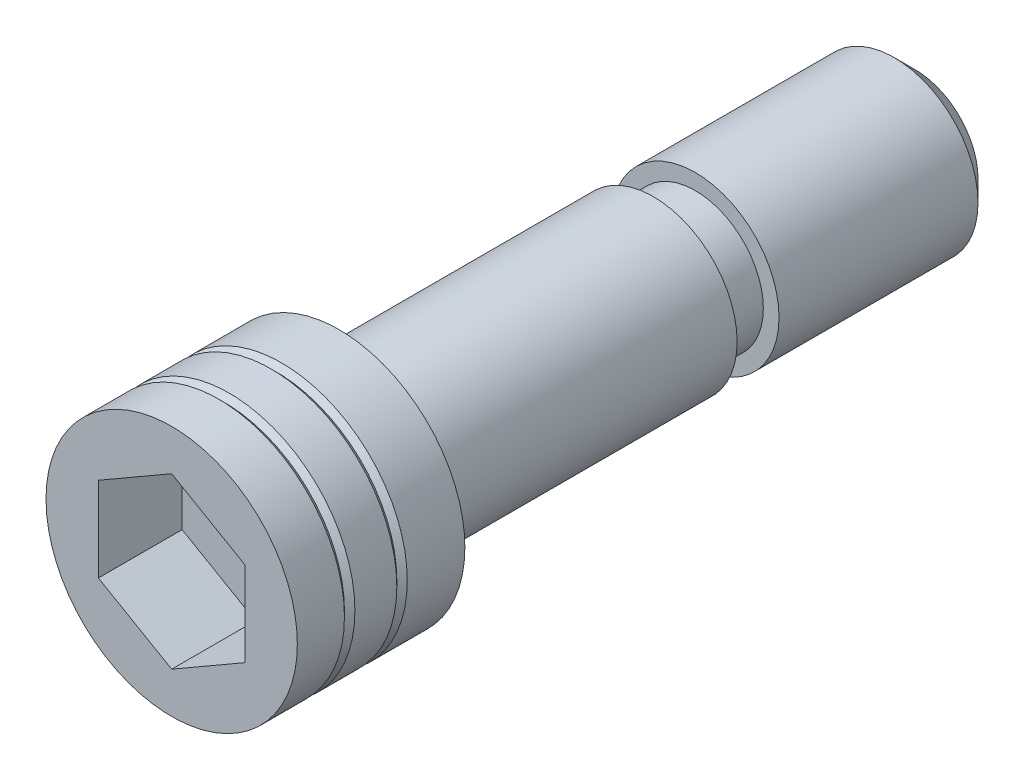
ISO-10303-21;
HEADER;
FILE_DESCRIPTION(('STEP AP214'),'2;1');
FILE_NAME('part.step','',(''),(''),'','','');
FILE_SCHEMA(('AUTOMOTIVE_DESIGN { 1 0 10303 214 1 1 1 1 }'));
ENDSEC;
DATA;
#1=APPLICATION_CONTEXT('core data for automotive mechanical design processes');
#2=APPLICATION_PROTOCOL_DEFINITION('international standard','automotive_design',2000,#1);
#3=PRODUCT_CONTEXT('',#1,'mechanical');
#4=PRODUCT('Part','Part','',(#3));
#5=PRODUCT_RELATED_PRODUCT_CATEGORY('part','',(#4));
#6=PRODUCT_DEFINITION_FORMATION('','',#4);
#7=PRODUCT_DEFINITION_CONTEXT('part definition',#1,'design');
#8=PRODUCT_DEFINITION('design','',#6,#7);
#9=PRODUCT_DEFINITION_SHAPE('','',#8);
#10=(LENGTH_UNIT() NAMED_UNIT(*) SI_UNIT(.MILLI.,.METRE.));
#11=(NAMED_UNIT(*) PLANE_ANGLE_UNIT() SI_UNIT($,.RADIAN.));
#12=(NAMED_UNIT(*) SI_UNIT($,.STERADIAN.) SOLID_ANGLE_UNIT());
#13=UNCERTAINTY_MEASURE_WITH_UNIT(LENGTH_MEASURE(1.E-05),#10,'distance_accuracy_value','');
#14=(GEOMETRIC_REPRESENTATION_CONTEXT(3) GLOBAL_UNCERTAINTY_ASSIGNED_CONTEXT((#13)) GLOBAL_UNIT_ASSIGNED_CONTEXT((#10,
#11,#12)) REPRESENTATION_CONTEXT('',''));
#15=CARTESIAN_POINT('',(0.,0.,0.));
#16=DIRECTION('',(0.,0.,1.));
#17=DIRECTION('',(1.,0.,0.));
#18=AXIS2_PLACEMENT_3D('',#15,#16,#17);
#19=CARTESIAN_POINT('',(0.,0.,25.));
#20=DIRECTION('',(0.,0.,1.));
#21=DIRECTION('',(1.,0.,0.));
#22=AXIS2_PLACEMENT_3D('',#19,#20,#21);
#23=CYLINDRICAL_SURFACE('',#22,12.);
#24=CARTESIAN_POINT('',(0.,0.,0.));
#25=DIRECTION('',(0.,0.,1.));
#26=DIRECTION('',(1.,0.,0.));
#27=AXIS2_PLACEMENT_3D('',#24,#25,#26);
#28=CIRCLE('',#27,12.);
#29=CARTESIAN_POINT('',(12.,0.,0.));
#30=VERTEX_POINT('',#29);
#31=EDGE_CURVE('E23',#30,#30,#28,.T.);
#32=ORIENTED_EDGE('',*,*,#31,.T.);
#33=EDGE_LOOP('',(#32));
#34=FACE_BOUND('',#33,.T.);
#35=CARTESIAN_POINT('',(0.,0.,5.5));
#36=DIRECTION('',(0.,0.,-1.));
#37=DIRECTION('',(-1.,0.,0.));
#38=AXIS2_PLACEMENT_3D('',#35,#36,#37);
#39=CIRCLE('',#38,12.);
#40=CARTESIAN_POINT('',(-12.,0.,5.5));
#41=VERTEX_POINT('',#40);
#42=EDGE_CURVE('E18',#41,#41,#39,.F.);
#43=ORIENTED_EDGE('',*,*,#42,.F.);
#44=EDGE_LOOP('',(#43));
#45=FACE_BOUND('',#44,.T.);
#46=ADVANCED_FACE('F14',(#34,#45),#23,.T.);
#47=CARTESIAN_POINT('',(-8.,0.,0.));
#48=DIRECTION('',(0.,0.,1.));
#49=DIRECTION('',(1.,0.,0.));
#50=AXIS2_PLACEMENT_3D('',#47,#48,#49);
#51=PLANE('',#50);
#52=ORIENTED_EDGE('',*,*,#31,.F.);
#53=EDGE_LOOP('',(#52));
#54=FACE_BOUND('',#53,.T.);
#55=CARTESIAN_POINT('',(0.,0.,0.));
#56=DIRECTION('',(0.,0.,1.));
#57=DIRECTION('',(1.,0.,0.));
#58=AXIS2_PLACEMENT_3D('',#55,#56,#57);
#59=CIRCLE('',#58,8.);
#60=CARTESIAN_POINT('',(8.,0.,0.));
#61=VERTEX_POINT('',#60);
#62=EDGE_CURVE('E142',#61,#61,#59,.T.);
#63=ORIENTED_EDGE('',*,*,#62,.T.);
#64=EDGE_LOOP('',(#63));
#65=FACE_BOUND('',#64,.T.);
#66=ADVANCED_FACE('F187',(#54,#65),#51,.F.);
#67=CARTESIAN_POINT('',(0.,0.,25.));
#68=DIRECTION('',(0.,0.,1.));
#69=DIRECTION('',(1.,0.,0.));
#70=AXIS2_PLACEMENT_3D('',#67,#68,#69);
#71=CYLINDRICAL_SURFACE('',#70,8.);
#72=ORIENTED_EDGE('',*,*,#62,.F.);
#73=EDGE_LOOP('',(#72));
#74=FACE_BOUND('',#73,.T.);
#75=CARTESIAN_POINT('',(0.,0.,-30.));
#76=DIRECTION('',(0.,0.,1.));
#77=DIRECTION('',(1.,0.,0.));
#78=AXIS2_PLACEMENT_3D('',#75,#76,#77);
#79=CIRCLE('',#78,8.);
#80=CARTESIAN_POINT('',(8.,0.,-30.));
#81=VERTEX_POINT('',#80);
#82=EDGE_CURVE('E139',#81,#81,#79,.T.);
#83=ORIENTED_EDGE('',*,*,#82,.T.);
#84=EDGE_LOOP('',(#83));
#85=FACE_BOUND('',#84,.T.);
#86=ADVANCED_FACE('F248',(#74,#85),#71,.T.);
#87=CARTESIAN_POINT('',(-6.5,0.,-30.));
#88=DIRECTION('',(0.,0.,1.));
#89=DIRECTION('',(1.,0.,0.));
#90=AXIS2_PLACEMENT_3D('',#87,#88,#89);
#91=PLANE('',#90);
#92=ORIENTED_EDGE('',*,*,#82,.F.);
#93=EDGE_LOOP('',(#92));
#94=FACE_BOUND('',#93,.T.);
#95=CARTESIAN_POINT('',(0.,0.,-30.));
#96=DIRECTION('',(0.,0.,1.));
#97=DIRECTION('',(1.,0.,0.));
#98=AXIS2_PLACEMENT_3D('',#95,#96,#97);
#99=CIRCLE('',#98,6.5);
#100=CARTESIAN_POINT('',(6.5,0.,-30.));
#101=VERTEX_POINT('',#100);
#102=EDGE_CURVE('E136',#101,#101,#99,.T.);
#103=ORIENTED_EDGE('',*,*,#102,.T.);
#104=EDGE_LOOP('',(#103));
#105=FACE_BOUND('',#104,.T.);
#106=ADVANCED_FACE('F244',(#94,#105),#91,.F.);
#107=CARTESIAN_POINT('',(0.,0.,25.));
#108=DIRECTION('',(0.,0.,1.));
#109=DIRECTION('',(1.,0.,0.));
#110=AXIS2_PLACEMENT_3D('',#107,#108,#109);
#111=CYLINDRICAL_SURFACE('',#110,6.5);
#112=ORIENTED_EDGE('',*,*,#102,.F.);
#113=EDGE_LOOP('',(#112));
#114=FACE_BOUND('',#113,.T.);
#115=CARTESIAN_POINT('',(0.,0.,-34.));
#116=DIRECTION('',(0.,0.,1.));
#117=DIRECTION('',(1.,0.,0.));
#118=AXIS2_PLACEMENT_3D('',#115,#116,#117);
#119=CIRCLE('',#118,6.5);
#120=CARTESIAN_POINT('',(6.5,0.,-34.));
#121=VERTEX_POINT('',#120);
#122=EDGE_CURVE('E133',#121,#121,#119,.T.);
#123=ORIENTED_EDGE('',*,*,#122,.T.);
#124=EDGE_LOOP('',(#123));
#125=FACE_BOUND('',#124,.T.);
#126=ADVANCED_FACE('F240',(#114,#125),#111,.T.);
#127=CARTESIAN_POINT('',(-8.,0.,-34.));
#128=DIRECTION('',(0.,0.,-1.));
#129=DIRECTION('',(-1.,0.,0.));
#130=AXIS2_PLACEMENT_3D('',#127,#128,#129);
#131=PLANE('',#130);
#132=ORIENTED_EDGE('',*,*,#122,.F.);
#133=EDGE_LOOP('',(#132));
#134=FACE_BOUND('',#133,.T.);
#135=CARTESIAN_POINT('',(0.,0.,-34.));
#136=DIRECTION('',(0.,0.,1.));
#137=DIRECTION('',(1.,0.,0.));
#138=AXIS2_PLACEMENT_3D('',#135,#136,#137);
#139=CIRCLE('',#138,8.);
#140=CARTESIAN_POINT('',(8.,0.,-34.));
#141=VERTEX_POINT('',#140);
#142=EDGE_CURVE('E130',#141,#141,#139,.T.);
#143=ORIENTED_EDGE('',*,*,#142,.T.);
#144=EDGE_LOOP('',(#143));
#145=FACE_BOUND('',#144,.T.);
#146=ADVANCED_FACE('F236',(#134,#145),#131,.F.);
#147=CARTESIAN_POINT('',(0.,0.,25.));
#148=DIRECTION('',(0.,0.,1.));
#149=DIRECTION('',(1.,0.,0.));
#150=AXIS2_PLACEMENT_3D('',#147,#148,#149);
#151=CYLINDRICAL_SURFACE('',#150,8.);
#152=ORIENTED_EDGE('',*,*,#142,.F.);
#153=EDGE_LOOP('',(#152));
#154=FACE_BOUND('',#153,.T.);
#155=CARTESIAN_POINT('',(0.,0.,-53.));
#156=DIRECTION('',(0.,0.,1.));
#157=DIRECTION('',(1.,0.,0.));
#158=AXIS2_PLACEMENT_3D('',#155,#156,#157);
#159=CIRCLE('',#158,8.);
#160=CARTESIAN_POINT('',(8.,0.,-53.));
#161=VERTEX_POINT('',#160);
#162=EDGE_CURVE('E127',#161,#161,#159,.T.);
#163=ORIENTED_EDGE('',*,*,#162,.T.);
#164=EDGE_LOOP('',(#163));
#165=FACE_BOUND('',#164,.T.);
#166=ADVANCED_FACE('F232',(#154,#165),#151,.T.);
#167=CARTESIAN_POINT('',(0.,0.,-55.));
#168=DIRECTION('',(0.,0.,1.));
#169=DIRECTION('',(1.,0.,0.));
#170=AXIS2_PLACEMENT_3D('',#167,#168,#169);
#171=CONICAL_SURFACE('',#170,6.,0.785398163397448);
#172=ORIENTED_EDGE('',*,*,#162,.F.);
#173=EDGE_LOOP('',(#172));
#174=FACE_BOUND('',#173,.T.);
#175=CARTESIAN_POINT('',(0.,0.,-55.));
#176=DIRECTION('',(0.,0.,1.));
#177=DIRECTION('',(1.,0.,0.));
#178=AXIS2_PLACEMENT_3D('',#175,#176,#177);
#179=CIRCLE('',#178,6.);
#180=CARTESIAN_POINT('',(6.,0.,-55.));
#181=VERTEX_POINT('',#180);
#182=EDGE_CURVE('E118',#181,#181,#179,.T.);
#183=ORIENTED_EDGE('',*,*,#182,.T.);
#184=EDGE_LOOP('',(#183));
#185=FACE_BOUND('',#184,.T.);
#186=ADVANCED_FACE('F228',(#174,#185),#171,.T.);
#187=CARTESIAN_POINT('',(0.,0.,-55.));
#188=DIRECTION('',(0.,0.,1.));
#189=DIRECTION('',(1.,0.,0.));
#190=AXIS2_PLACEMENT_3D('',#187,#188,#189);
#191=PLANE('',#190);
#192=ORIENTED_EDGE('',*,*,#182,.F.);
#193=EDGE_LOOP('',(#192));
#194=FACE_BOUND('',#193,.T.);
#195=ADVANCED_FACE('F224',(#194),#191,.F.);
#196=CARTESIAN_POINT('',(0.,0.,4.3212600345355));
#197=DIRECTION('',(0.,0.,-1.));
#198=DIRECTION('',(-1.,0.,0.));
#199=AXIS2_PLACEMENT_3D('',#196,#197,#198);
#200=CONICAL_SURFACE('',#199,13.1787399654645,0.785398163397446);
#201=CARTESIAN_POINT('',(0.,0.,6.));
#202=DIRECTION('',(0.,0.,-1.));
#203=DIRECTION('',(-1.,0.,0.));
#204=AXIS2_PLACEMENT_3D('',#201,#202,#203);
#205=CIRCLE('',#204,11.5);
#206=CARTESIAN_POINT('',(-11.5,0.,6.));
#207=VERTEX_POINT('',#206);
#208=EDGE_CURVE('E155',#207,#207,#205,.T.);
#209=ORIENTED_EDGE('',*,*,#208,.T.);
#210=EDGE_LOOP('',(#209));
#211=FACE_BOUND('',#210,.T.);
#212=ORIENTED_EDGE('',*,*,#42,.T.);
#213=EDGE_LOOP('',(#212));
#214=FACE_BOUND('',#213,.T.);
#215=ADVANCED_FACE('F227',(#211,#214),#200,.T.);
#216=CARTESIAN_POINT('',(0.,0.,6.));
#217=DIRECTION('',(0.,0.,1.));
#218=DIRECTION('',(1.,0.,0.));
#219=AXIS2_PLACEMENT_3D('',#216,#217,#218);
#220=CONICAL_SURFACE('',#219,11.5,0.785398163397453);
#221=ORIENTED_EDGE('',*,*,#208,.F.);
#222=EDGE_LOOP('',(#221));
#223=FACE_BOUND('',#222,.T.);
#224=CARTESIAN_POINT('',(0.,0.,6.5));
#225=DIRECTION('',(0.,0.,1.));
#226=DIRECTION('',(1.,0.,0.));
#227=AXIS2_PLACEMENT_3D('',#224,#225,#226);
#228=CIRCLE('',#227,12.);
#229=CARTESIAN_POINT('',(12.,0.,6.5));
#230=VERTEX_POINT('',#229);
#231=EDGE_CURVE('E153',#230,#230,#228,.F.);
#232=ORIENTED_EDGE('',*,*,#231,.T.);
#233=EDGE_LOOP('',(#232));
#234=FACE_BOUND('',#233,.T.);
#235=ADVANCED_FACE('F204',(#223,#234),#220,.T.);
#236=CARTESIAN_POINT('',(-7.,12.1243556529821,8.));
#237=DIRECTION('',(0.,0.,1.));
#238=DIRECTION('',(1.,0.,0.));
#239=AXIS2_PLACEMENT_3D('',#236,#237,#238);
#240=PLANE('',#239);
#241=DIRECTION('',(-0.866025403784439,0.5,0.));
#242=VECTOR('',#241,1.);
#243=CARTESIAN_POINT('',(7.,4.04145188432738,8.));
#244=LINE('',#243,#242);
#245=CARTESIAN_POINT('',(7.,4.04145188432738,8.));
#246=VERTEX_POINT('',#245);
#247=CARTESIAN_POINT('',(0.,8.08290376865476,8.));
#248=VERTEX_POINT('',#247);
#249=EDGE_CURVE('E102',#246,#248,#244,.T.);
#250=ORIENTED_EDGE('',*,*,#249,.T.);
#251=DIRECTION('',(-0.866025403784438,-0.5,0.));
#252=VECTOR('',#251,1.);
#253=CARTESIAN_POINT('',(0.,8.08290376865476,8.));
#254=LINE('',#253,#252);
#255=CARTESIAN_POINT('',(-7.,4.04145188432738,8.));
#256=VERTEX_POINT('',#255);
#257=EDGE_CURVE('E105',#248,#256,#254,.T.);
#258=ORIENTED_EDGE('',*,*,#257,.T.);
#259=DIRECTION('',(0.,-1.,0.));
#260=VECTOR('',#259,1.);
#261=CARTESIAN_POINT('',(-7.,4.04145188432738,8.));
#262=LINE('',#261,#260);
#263=CARTESIAN_POINT('',(-7.,-4.04145188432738,8.));
#264=VERTEX_POINT('',#263);
#265=EDGE_CURVE('E77',#256,#264,#262,.T.);
#266=ORIENTED_EDGE('',*,*,#265,.T.);
#267=DIRECTION('',(0.866025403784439,-0.5,0.));
#268=VECTOR('',#267,1.);
#269=CARTESIAN_POINT('',(-7.,-4.04145188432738,8.));
#270=LINE('',#269,#268);
#271=CARTESIAN_POINT('',(0.,-8.08290376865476,8.));
#272=VERTEX_POINT('',#271);
#273=EDGE_CURVE('E108',#264,#272,#270,.T.);
#274=ORIENTED_EDGE('',*,*,#273,.T.);
#275=DIRECTION('',(0.866025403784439,0.5,0.));
#276=VECTOR('',#275,1.);
#277=CARTESIAN_POINT('',(0.,-8.08290376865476,8.));
#278=LINE('',#277,#276);
#279=CARTESIAN_POINT('',(7.,-4.04145188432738,8.));
#280=VERTEX_POINT('',#279);
#281=EDGE_CURVE('E111',#272,#280,#278,.T.);
#282=ORIENTED_EDGE('',*,*,#281,.T.);
#283=DIRECTION('',(0.,1.,0.));
#284=VECTOR('',#283,1.);
#285=CARTESIAN_POINT('',(7.,-4.04145188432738,8.));
#286=LINE('',#285,#284);
#287=EDGE_CURVE('E114',#280,#246,#286,.T.);
#288=ORIENTED_EDGE('',*,*,#287,.T.);
#289=EDGE_LOOP('',(#250,#258,#266,#274,#282,#288));
#290=FACE_BOUND('',#289,.T.);
#291=ADVANCED_FACE('F201',(#290),#240,.T.);
#292=CARTESIAN_POINT('',(-7.,4.04145188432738,8.));
#293=DIRECTION('',(-1.,0.,0.));
#294=DIRECTION('',(0.,-1.,0.));
#295=AXIS2_PLACEMENT_3D('',#292,#293,#294);
#296=PLANE('',#295);
#297=DIRECTION('',(0.,-1.,0.));
#298=VECTOR('',#297,1.);
#299=CARTESIAN_POINT('',(-7.,4.04145188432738,16.));
#300=LINE('',#299,#298);
#301=CARTESIAN_POINT('',(-7.,4.04145188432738,16.));
#302=VERTEX_POINT('',#301);
#303=CARTESIAN_POINT('',(-7.,-4.04145188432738,16.));
#304=VERTEX_POINT('',#303);
#305=EDGE_CURVE('E74',#302,#304,#300,.T.);
#306=ORIENTED_EDGE('',*,*,#305,.T.);
#307=DIRECTION('',(0.,0.,1.));
#308=VECTOR('',#307,1.);
#309=CARTESIAN_POINT('',(-7.,-4.04145188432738,8.));
#310=LINE('',#309,#308);
#311=EDGE_CURVE('E81',#264,#304,#310,.T.);
#312=ORIENTED_EDGE('',*,*,#311,.F.);
#313=ORIENTED_EDGE('',*,*,#265,.F.);
#314=DIRECTION('',(0.,0.,1.));
#315=VECTOR('',#314,1.);
#316=CARTESIAN_POINT('',(-7.,4.04145188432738,8.));
#317=LINE('',#316,#315);
#318=EDGE_CURVE('E70',#256,#302,#317,.T.);
#319=ORIENTED_EDGE('',*,*,#318,.T.);
#320=EDGE_LOOP('',(#306,#312,#313,#319));
#321=FACE_BOUND('',#320,.T.);
#322=ADVANCED_FACE('F72',(#321),#296,.F.);
#323=CARTESIAN_POINT('',(-7.,-4.04145188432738,8.));
#324=DIRECTION('',(-0.5,-0.866025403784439,0.));
#325=DIRECTION('',(0.866025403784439,-0.5,0.));
#326=AXIS2_PLACEMENT_3D('',#323,#324,#325);
#327=PLANE('',#326);
#328=DIRECTION('',(0.866025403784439,-0.5,0.));
#329=VECTOR('',#328,1.);
#330=CARTESIAN_POINT('',(-7.,-4.04145188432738,16.));
#331=LINE('',#330,#329);
#332=CARTESIAN_POINT('',(0.,-8.08290376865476,16.));
#333=VERTEX_POINT('',#332);
#334=EDGE_CURVE('E92',#304,#333,#331,.T.);
#335=ORIENTED_EDGE('',*,*,#334,.T.);
#336=DIRECTION('',(0.,0.,1.));
#337=VECTOR('',#336,1.);
#338=CARTESIAN_POINT('',(0.,-8.08290376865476,8.));
#339=LINE('',#338,#337);
#340=EDGE_CURVE('E121',#272,#333,#339,.T.);
#341=ORIENTED_EDGE('',*,*,#340,.F.);
#342=ORIENTED_EDGE('',*,*,#273,.F.);
#343=ORIENTED_EDGE('',*,*,#311,.T.);
#344=EDGE_LOOP('',(#335,#341,#342,#343));
#345=FACE_BOUND('',#344,.T.);
#346=ADVANCED_FACE('F213',(#345),#327,.F.);
#347=CARTESIAN_POINT('',(0.,-8.08290376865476,8.));
#348=DIRECTION('',(0.5,-0.866025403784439,0.));
#349=DIRECTION('',(0.866025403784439,0.5,0.));
#350=AXIS2_PLACEMENT_3D('',#347,#348,#349);
#351=PLANE('',#350);
#352=DIRECTION('',(0.866025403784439,0.5,0.));
#353=VECTOR('',#352,1.);
#354=CARTESIAN_POINT('',(0.,-8.08290376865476,16.));
#355=LINE('',#354,#353);
#356=CARTESIAN_POINT('',(7.,-4.04145188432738,16.));
#357=VERTEX_POINT('',#356);
#358=EDGE_CURVE('E94',#333,#357,#355,.T.);
#359=ORIENTED_EDGE('',*,*,#358,.T.);
#360=DIRECTION('',(0.,0.,1.));
#361=VECTOR('',#360,1.);
#362=CARTESIAN_POINT('',(7.,-4.04145188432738,8.));
#363=LINE('',#362,#361);
#364=EDGE_CURVE('E119',#280,#357,#363,.T.);
#365=ORIENTED_EDGE('',*,*,#364,.F.);
#366=ORIENTED_EDGE('',*,*,#281,.F.);
#367=ORIENTED_EDGE('',*,*,#340,.T.);
#368=EDGE_LOOP('',(#359,#365,#366,#367));
#369=FACE_BOUND('',#368,.T.);
#370=ADVANCED_FACE('F210',(#369),#351,.F.);
#371=CARTESIAN_POINT('',(7.,-4.04145188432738,8.));
#372=DIRECTION('',(1.,0.,0.));
#373=DIRECTION('',(0.,1.,0.));
#374=AXIS2_PLACEMENT_3D('',#371,#372,#373);
#375=PLANE('',#374);
#376=DIRECTION('',(0.,1.,0.));
#377=VECTOR('',#376,1.);
#378=CARTESIAN_POINT('',(7.,-4.04145188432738,16.));
#379=LINE('',#378,#377);
#380=CARTESIAN_POINT('',(7.,4.04145188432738,16.));
#381=VERTEX_POINT('',#380);
#382=EDGE_CURVE('E100',#357,#381,#379,.T.);
#383=ORIENTED_EDGE('',*,*,#382,.T.);
#384=DIRECTION('',(0.,0.,1.));
#385=VECTOR('',#384,1.);
#386=CARTESIAN_POINT('',(7.,4.04145188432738,8.));
#387=LINE('',#386,#385);
#388=EDGE_CURVE('E38',#246,#381,#387,.T.);
#389=ORIENTED_EDGE('',*,*,#388,.F.);
#390=ORIENTED_EDGE('',*,*,#287,.F.);
#391=ORIENTED_EDGE('',*,*,#364,.T.);
#392=EDGE_LOOP('',(#383,#389,#390,#391));
#393=FACE_BOUND('',#392,.T.);
#394=ADVANCED_FACE('F206',(#393),#375,.F.);
#395=CARTESIAN_POINT('',(7.,4.04145188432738,8.));
#396=DIRECTION('',(0.5,0.866025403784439,0.));
#397=DIRECTION('',(-0.866025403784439,0.5,0.));
#398=AXIS2_PLACEMENT_3D('',#395,#396,#397);
#399=PLANE('',#398);
#400=DIRECTION('',(-0.866025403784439,0.5,0.));
#401=VECTOR('',#400,1.);
#402=CARTESIAN_POINT('',(7.,4.04145188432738,16.));
#403=LINE('',#402,#401);
#404=CARTESIAN_POINT('',(0.,8.08290376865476,16.));
#405=VERTEX_POINT('',#404);
#406=EDGE_CURVE('E31',#381,#405,#403,.T.);
#407=ORIENTED_EDGE('',*,*,#406,.T.);
#408=DIRECTION('',(0.,0.,1.));
#409=VECTOR('',#408,1.);
#410=CARTESIAN_POINT('',(0.,8.08290376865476,8.));
#411=LINE('',#410,#409);
#412=EDGE_CURVE('E82',#248,#405,#411,.T.);
#413=ORIENTED_EDGE('',*,*,#412,.F.);
#414=ORIENTED_EDGE('',*,*,#249,.F.);
#415=ORIENTED_EDGE('',*,*,#388,.T.);
#416=EDGE_LOOP('',(#407,#413,#414,#415));
#417=FACE_BOUND('',#416,.T.);
#418=ADVANCED_FACE('F209',(#417),#399,.F.);
#419=CARTESIAN_POINT('',(0.,8.08290376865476,8.));
#420=DIRECTION('',(-0.5,0.866025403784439,0.));
#421=DIRECTION('',(-0.866025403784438,-0.5,0.));
#422=AXIS2_PLACEMENT_3D('',#419,#420,#421);
#423=PLANE('',#422);
#424=DIRECTION('',(-0.866025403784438,-0.5,0.));
#425=VECTOR('',#424,1.);
#426=CARTESIAN_POINT('',(0.,8.08290376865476,16.));
#427=LINE('',#426,#425);
#428=EDGE_CURVE('E85',#405,#302,#427,.T.);
#429=ORIENTED_EDGE('',*,*,#428,.T.);
#430=ORIENTED_EDGE('',*,*,#318,.F.);
#431=ORIENTED_EDGE('',*,*,#257,.F.);
#432=ORIENTED_EDGE('',*,*,#412,.T.);
#433=EDGE_LOOP('',(#429,#430,#431,#432));
#434=FACE_BOUND('',#433,.T.);
#435=ADVANCED_FACE('F86',(#434),#423,.F.);
#436=CARTESIAN_POINT('',(-12.,0.,16.));
#437=DIRECTION('',(0.,0.,-1.));
#438=DIRECTION('',(-1.,0.,0.));
#439=AXIS2_PLACEMENT_3D('',#436,#437,#438);
#440=PLANE('',#439);
#441=ORIENTED_EDGE('',*,*,#428,.F.);
#442=ORIENTED_EDGE('',*,*,#406,.F.);
#443=ORIENTED_EDGE('',*,*,#382,.F.);
#444=ORIENTED_EDGE('',*,*,#358,.F.);
#445=ORIENTED_EDGE('',*,*,#334,.F.);
#446=ORIENTED_EDGE('',*,*,#305,.F.);
#447=EDGE_LOOP('',(#441,#442,#443,#444,#445,#446));
#448=FACE_BOUND('',#447,.T.);
#449=CARTESIAN_POINT('',(0.,0.,16.));
#450=DIRECTION('',(0.,0.,1.));
#451=DIRECTION('',(1.,0.,0.));
#452=AXIS2_PLACEMENT_3D('',#449,#450,#451);
#453=CIRCLE('',#452,12.);
#454=CARTESIAN_POINT('',(12.,0.,16.));
#455=VERTEX_POINT('',#454);
#456=EDGE_CURVE('E9',#455,#455,#453,.T.);
#457=ORIENTED_EDGE('',*,*,#456,.T.);
#458=EDGE_LOOP('',(#457));
#459=FACE_BOUND('',#458,.T.);
#460=ADVANCED_FACE('F16',(#448,#459),#440,.F.);
#461=ORIENTED_EDGE('',*,*,#456,.F.);
#462=EDGE_LOOP('',(#461));
#463=FACE_BOUND('',#462,.T.);
#464=CARTESIAN_POINT('',(0.,0.,11.5));
#465=DIRECTION('',(0.,0.,1.));
#466=DIRECTION('',(1.,0.,0.));
#467=AXIS2_PLACEMENT_3D('',#464,#465,#466);
#468=CIRCLE('',#467,12.);
#469=CARTESIAN_POINT('',(12.,0.,11.5));
#470=VERTEX_POINT('',#469);
#471=EDGE_CURVE('E147',#470,#470,#468,.F.);
#472=ORIENTED_EDGE('',*,*,#471,.F.);
#473=EDGE_LOOP('',(#472));
#474=FACE_BOUND('',#473,.T.);
#475=ADVANCED_FACE('F173',(#463,#474),#23,.T.);
#476=CARTESIAN_POINT('',(0.,0.,11.));
#477=DIRECTION('',(0.,0.,1.));
#478=DIRECTION('',(1.,0.,0.));
#479=AXIS2_PLACEMENT_3D('',#476,#477,#478);
#480=CONICAL_SURFACE('',#479,11.5,0.785398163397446);
#481=CARTESIAN_POINT('',(0.,0.,11.));
#482=DIRECTION('',(0.,0.,-1.));
#483=DIRECTION('',(-1.,0.,0.));
#484=AXIS2_PLACEMENT_3D('',#481,#482,#483);
#485=CIRCLE('',#484,11.5);
#486=CARTESIAN_POINT('',(-11.5,0.,11.));
#487=VERTEX_POINT('',#486);
#488=EDGE_CURVE('E151',#487,#487,#485,.T.);
#489=ORIENTED_EDGE('',*,*,#488,.F.);
#490=EDGE_LOOP('',(#489));
#491=FACE_BOUND('',#490,.T.);
#492=ORIENTED_EDGE('',*,*,#471,.T.);
#493=EDGE_LOOP('',(#492));
#494=FACE_BOUND('',#493,.T.);
#495=ADVANCED_FACE('F170',(#491,#494),#480,.T.);
#496=CARTESIAN_POINT('',(0.,0.,9.32126003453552));
#497=DIRECTION('',(0.,0.,-1.));
#498=DIRECTION('',(-1.,0.,0.));
#499=AXIS2_PLACEMENT_3D('',#496,#497,#498);
#500=CONICAL_SURFACE('',#499,13.1787399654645,0.785398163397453);
#501=ORIENTED_EDGE('',*,*,#488,.T.);
#502=EDGE_LOOP('',(#501));
#503=FACE_BOUND('',#502,.T.);
#504=CARTESIAN_POINT('',(0.,0.,10.5));
#505=DIRECTION('',(0.,0.,-1.));
#506=DIRECTION('',(-1.,0.,0.));
#507=AXIS2_PLACEMENT_3D('',#504,#505,#506);
#508=CIRCLE('',#507,12.);
#509=CARTESIAN_POINT('',(-12.,0.,10.5));
#510=VERTEX_POINT('',#509);
#511=EDGE_CURVE('E150',#510,#510,#508,.F.);
#512=ORIENTED_EDGE('',*,*,#511,.T.);
#513=EDGE_LOOP('',(#512));
#514=FACE_BOUND('',#513,.T.);
#515=ADVANCED_FACE('F167',(#503,#514),#500,.T.);
#516=ORIENTED_EDGE('',*,*,#511,.F.);
#517=EDGE_LOOP('',(#516));
#518=FACE_BOUND('',#517,.T.);
#519=ORIENTED_EDGE('',*,*,#231,.F.);
#520=EDGE_LOOP('',(#519));
#521=FACE_BOUND('',#520,.T.);
#522=ADVANCED_FACE('F179',(#518,#521),#23,.T.);
#523=CLOSED_SHELL('',(#46,#66,#86,#106,#126,#146,#166,#186,#195,#215,#235,#291,#322,#346,#370,
#394,#418,#435,#460,#475,#495,#515,#522));
#524=MANIFOLD_SOLID_BREP('B1',#523);
#525=ADVANCED_BREP_SHAPE_REPRESENTATION('',(#18,#524),#14);
#526=SHAPE_DEFINITION_REPRESENTATION(#9,#525);
ENDSEC;
END-ISO-10303-21;
